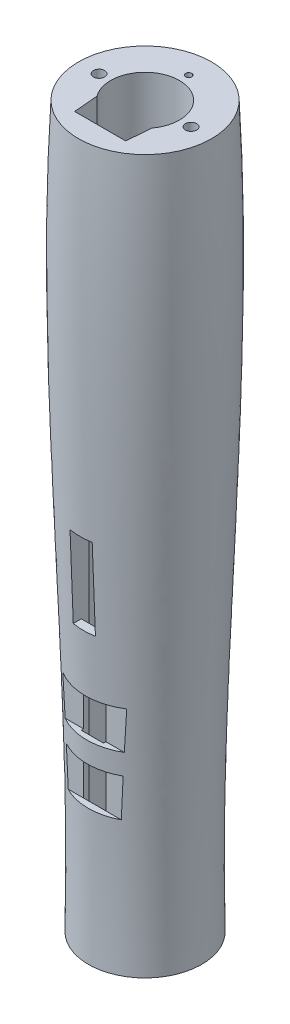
ISO-10303-21;
HEADER;
FILE_DESCRIPTION(('STEP AP214'),'2;1');
FILE_NAME('part.step','',(''),(''),'','','');
FILE_SCHEMA(('AUTOMOTIVE_DESIGN { 1 0 10303 214 1 1 1 1 }'));
ENDSEC;
DATA;
#1=APPLICATION_CONTEXT('core data for automotive mechanical design processes');
#2=APPLICATION_PROTOCOL_DEFINITION('international standard','automotive_design',2000,#1);
#3=PRODUCT_CONTEXT('',#1,'mechanical');
#4=PRODUCT('Part','Part','',(#3));
#5=PRODUCT_RELATED_PRODUCT_CATEGORY('part','',(#4));
#6=PRODUCT_DEFINITION_FORMATION('','',#4);
#7=PRODUCT_DEFINITION_CONTEXT('part definition',#1,'design');
#8=PRODUCT_DEFINITION('design','',#6,#7);
#9=PRODUCT_DEFINITION_SHAPE('','',#8);
#10=(LENGTH_UNIT() NAMED_UNIT(*) SI_UNIT(.MILLI.,.METRE.));
#11=(NAMED_UNIT(*) PLANE_ANGLE_UNIT() SI_UNIT($,.RADIAN.));
#12=(NAMED_UNIT(*) SI_UNIT($,.STERADIAN.) SOLID_ANGLE_UNIT());
#13=UNCERTAINTY_MEASURE_WITH_UNIT(LENGTH_MEASURE(1.E-05),#10,'distance_accuracy_value','');
#14=(GEOMETRIC_REPRESENTATION_CONTEXT(3) GLOBAL_UNCERTAINTY_ASSIGNED_CONTEXT((#13)) GLOBAL_UNIT_ASSIGNED_CONTEXT((#10,
#11,#12)) REPRESENTATION_CONTEXT('',''));
#15=CARTESIAN_POINT('',(0.,0.,0.));
#16=DIRECTION('',(0.,0.,1.));
#17=DIRECTION('',(1.,0.,0.));
#18=AXIS2_PLACEMENT_3D('',#15,#16,#17);
#19=CARTESIAN_POINT('',(-15.25,204.85,0.));
#20=CARTESIAN_POINT('',(-18.6607569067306,136.652495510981,0.));
#21=CARTESIAN_POINT('',(-8.44521283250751,68.0931069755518,0.));
#22=CARTESIAN_POINT('',(-15.25,0.,0.));
#23=B_SPLINE_CURVE_WITH_KNOTS('',3,(#19,#20,#21,#22),.UNSPECIFIED.,.F.,.F.,(4,4),(0.,1.),.UNSPECIFIED.);
#24=CARTESIAN_POINT('',(0.,0.,0.));
#25=DIRECTION('',(0.,-1.,0.));
#26=AXIS1_PLACEMENT('',#24,#25);
#27=SURFACE_OF_REVOLUTION('',#23,#26);
#28=CARTESIAN_POINT('',(0.,70.86,0.));
#29=DIRECTION('',(0.,-1.,0.));
#30=DIRECTION('',(0.,0.,-1.));
#31=AXIS2_PLACEMENT_3D('',#28,#29,#30);
#32=CIRCLE('',#31,13.0308951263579);
#33=CARTESIAN_POINT('',(6.08008908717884,70.86,11.5254823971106));
#34=VERTEX_POINT('',#33);
#35=CARTESIAN_POINT('',(-6.08008908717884,70.86,11.5254823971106));
#36=VERTEX_POINT('',#35);
#37=EDGE_CURVE('E295',#34,#36,#32,.T.);
#38=ORIENTED_EDGE('',*,*,#37,.T.);
#39=CARTESIAN_POINT('',(-6.50588851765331,79.76,11.5254823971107));
#40=CARTESIAN_POINT('',(-6.47930983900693,79.2656973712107,11.5254823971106));
#41=CARTESIAN_POINT('',(-6.45314593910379,78.771372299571,11.5254823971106));
#42=CARTESIAN_POINT('',(-6.40171921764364,77.7826795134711,11.5254823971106));
#43=CARTESIAN_POINT('',(-6.37645638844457,77.2883117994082,11.5254823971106));
#44=CARTESIAN_POINT('',(-6.32690299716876,76.299530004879,11.5254823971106));
#45=CARTESIAN_POINT('',(-6.30261243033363,75.8051159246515,11.5254823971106));
#46=CARTESIAN_POINT('',(-6.25507742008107,74.8162370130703,11.5254823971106));
#47=CARTESIAN_POINT('',(-6.2318329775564,74.3217721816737,11.5254823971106));
#48=CARTESIAN_POINT('',(-6.18646581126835,73.3327889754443,11.5254823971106));
#49=CARTESIAN_POINT('',(-6.16434309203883,72.8382706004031,11.5254823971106));
#50=CARTESIAN_POINT('',(-6.12129703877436,71.8491769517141,11.5254823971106));
#51=CARTESIAN_POINT('',(-6.10037371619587,71.3546016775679,11.5254823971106));
#52=CARTESIAN_POINT('',(-6.08008908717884,70.86,11.5254823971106));
#53=B_SPLINE_CURVE_WITH_KNOTS('',3,(#39,#40,#41,#42,#43,#44,#45,#46,#47,#48,#49,#50,#51,#52),
.UNSPECIFIED.,.F.,.F.,(4,2,2,2,2,2,4),(0.,1.48505007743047,2.97008755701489,4.45511776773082,
5.94014924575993,7.42518672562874,8.91023838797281),.UNSPECIFIED.);
#54=CARTESIAN_POINT('',(-6.50588851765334,79.76,11.5254823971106));
#55=VERTEX_POINT('',#54);
#56=EDGE_CURVE('E391',#55,#36,#53,.T.);
#57=ORIENTED_EDGE('',*,*,#56,.F.);
#58=CARTESIAN_POINT('',(0.,79.76,0.));
#59=DIRECTION('',(0.,-1.,0.));
#60=DIRECTION('',(0.,0.,-1.));
#61=AXIS2_PLACEMENT_3D('',#58,#59,#60);
#62=CIRCLE('',#61,13.23492840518);
#63=CARTESIAN_POINT('',(6.50588851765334,79.76,11.5254823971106));
#64=VERTEX_POINT('',#63);
#65=EDGE_CURVE('E292',#55,#64,#62,.F.);
#66=ORIENTED_EDGE('',*,*,#65,.T.);
#67=CARTESIAN_POINT('',(6.08008908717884,70.86,11.5254823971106));
#68=CARTESIAN_POINT('',(6.10037371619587,71.3546016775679,11.5254823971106));
#69=CARTESIAN_POINT('',(6.12129703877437,71.8491769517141,11.5254823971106));
#70=CARTESIAN_POINT('',(6.16434309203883,72.8382706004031,11.5254823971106));
#71=CARTESIAN_POINT('',(6.18646581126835,73.3327889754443,11.5254823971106));
#72=CARTESIAN_POINT('',(6.23183297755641,74.3217721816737,11.5254823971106));
#73=CARTESIAN_POINT('',(6.25507742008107,74.8162370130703,11.5254823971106));
#74=CARTESIAN_POINT('',(6.30261243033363,75.8051159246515,11.5254823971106));
#75=CARTESIAN_POINT('',(6.32690299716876,76.299530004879,11.5254823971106));
#76=CARTESIAN_POINT('',(6.37645638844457,77.2883117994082,11.5254823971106));
#77=CARTESIAN_POINT('',(6.40171921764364,77.7826795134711,11.5254823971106));
#78=CARTESIAN_POINT('',(6.45314593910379,78.771372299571,11.5254823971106));
#79=CARTESIAN_POINT('',(6.47930983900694,79.2656973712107,11.5254823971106));
#80=CARTESIAN_POINT('',(6.50588851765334,79.76,11.5254823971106));
#81=B_SPLINE_CURVE_WITH_KNOTS('',3,(#67,#68,#69,#70,#71,#72,#73,#74,#75,#76,#77,#78,#79,#80),
.UNSPECIFIED.,.F.,.F.,(4,2,2,2,2,2,4),(0.,1.48505166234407,2.97008914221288,4.45512062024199,
5.94015083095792,7.42518831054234,8.91023838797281),.UNSPECIFIED.);
#82=EDGE_CURVE('E397',#34,#64,#81,.T.);
#83=ORIENTED_EDGE('',*,*,#82,.F.);
#84=EDGE_LOOP('',(#38,#57,#66,#83));
#85=FACE_BOUND('',#84,.T.);
#86=CARTESIAN_POINT('',(0.,84.59,0.));
#87=DIRECTION('',(0.,-1.,0.));
#88=DIRECTION('',(0.,0.,-1.));
#89=AXIS2_PLACEMENT_3D('',#86,#87,#88);
#90=CIRCLE('',#89,13.3706468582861);
#91=CARTESIAN_POINT('',(6.7777173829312,84.59,11.5254823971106));
#92=VERTEX_POINT('',#91);
#93=CARTESIAN_POINT('',(-6.7777173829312,84.59,11.5254823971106));
#94=VERTEX_POINT('',#93);
#95=EDGE_CURVE('E294',#92,#94,#90,.T.);
#96=ORIENTED_EDGE('',*,*,#95,.T.);
#97=CARTESIAN_POINT('',(-7.32632067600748,93.49,11.5254823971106));
#98=CARTESIAN_POINT('',(-7.29464869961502,92.9956293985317,11.5254823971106));
#99=CARTESIAN_POINT('',(-7.26312403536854,92.5012493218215,11.5254823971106));
#100=CARTESIAN_POINT('',(-7.20041993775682,91.512468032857,11.5254823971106));
#101=CARTESIAN_POINT('',(-7.16924050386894,91.0180668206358,11.5254823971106));
#102=CARTESIAN_POINT('',(-7.10727740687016,90.0292400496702,11.5254823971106));
#103=CARTESIAN_POINT('',(-7.07649374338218,89.5348144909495,11.5254823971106));
#104=CARTESIAN_POINT('',(-7.01537536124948,88.5459354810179,11.5254823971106));
#105=CARTESIAN_POINT('',(-6.98504064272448,88.0514820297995,11.5254823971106));
#106=CARTESIAN_POINT('',(-6.92487520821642,87.0625440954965,11.5254823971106));
#107=CARTESIAN_POINT('',(-6.89504449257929,86.5680596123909,11.5254823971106));
#108=CARTESIAN_POINT('',(-6.83594498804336,85.5790561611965,11.5254823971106));
#109=CARTESIAN_POINT('',(-6.80667620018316,85.0845371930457,11.5254823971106));
#110=CARTESIAN_POINT('',(-6.77771738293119,84.59,11.5254823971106));
#111=B_SPLINE_CURVE_WITH_KNOTS('',3,(#97,#98,#99,#100,#101,#102,#103,#104,#105,#106,#107,#108,
#109,#110),.UNSPECIFIED.,.F.,.F.,(4,2,2,2,2,2,4),(0.,1.48615233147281,2.97230241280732,
4.45845107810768,5.94460013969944,7.43075022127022,8.91690304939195),.UNSPECIFIED.);
#112=CARTESIAN_POINT('',(-7.32632067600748,93.49,11.5254823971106));
#113=VERTEX_POINT('',#112);
#114=EDGE_CURVE('E355',#113,#94,#111,.T.);
#115=ORIENTED_EDGE('',*,*,#114,.F.);
#116=CARTESIAN_POINT('',(0.,93.49,0.));
#117=DIRECTION('',(0.,-1.,0.));
#118=DIRECTION('',(0.,0.,-1.));
#119=AXIS2_PLACEMENT_3D('',#116,#117,#118);
#120=CIRCLE('',#119,13.656929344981);
#121=CARTESIAN_POINT('',(7.32632067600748,93.49,11.5254823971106));
#122=VERTEX_POINT('',#121);
#123=EDGE_CURVE('E272',#113,#122,#120,.F.);
#124=ORIENTED_EDGE('',*,*,#123,.T.);
#125=CARTESIAN_POINT('',(6.77771738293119,84.59,11.5254823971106));
#126=CARTESIAN_POINT('',(6.80667620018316,85.0845371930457,11.5254823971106));
#127=CARTESIAN_POINT('',(6.83594498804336,85.5790561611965,11.5254823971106));
#128=CARTESIAN_POINT('',(6.89504449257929,86.5680596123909,11.5254823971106));
#129=CARTESIAN_POINT('',(6.92487520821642,87.0625440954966,11.5254823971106));
#130=CARTESIAN_POINT('',(6.98504064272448,88.0514820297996,11.5254823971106));
#131=CARTESIAN_POINT('',(7.01537536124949,88.5459354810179,11.5254823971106));
#132=CARTESIAN_POINT('',(7.07649374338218,89.5348144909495,11.5254823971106));
#133=CARTESIAN_POINT('',(7.10727740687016,90.0292400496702,11.5254823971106));
#134=CARTESIAN_POINT('',(7.16924050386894,91.0180668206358,11.5254823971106));
#135=CARTESIAN_POINT('',(7.20041993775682,91.512468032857,11.5254823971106));
#136=CARTESIAN_POINT('',(7.26312403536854,92.5012493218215,11.5254823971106));
#137=CARTESIAN_POINT('',(7.29464869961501,92.9956293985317,11.5254823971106));
#138=CARTESIAN_POINT('',(7.32632067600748,93.49,11.5254823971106));
#139=B_SPLINE_CURVE_WITH_KNOTS('',3,(#125,#126,#127,#128,#129,#130,#131,#132,#133,#134,#135,
#136,#137,#138),.UNSPECIFIED.,.F.,.F.,(4,2,2,2,2,2,4),(0.,1.48615282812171,2.97230290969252,
4.45845197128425,5.94460063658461,7.43075071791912,8.91690304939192),.UNSPECIFIED.);
#140=EDGE_CURVE('E358',#92,#122,#139,.T.);
#141=ORIENTED_EDGE('',*,*,#140,.F.);
#142=EDGE_LOOP('',(#96,#115,#124,#141));
#143=FACE_BOUND('',#142,.T.);
#144=CARTESIAN_POINT('',(0.,204.85,0.));
#145=DIRECTION('',(0.,-1.,0.));
#146=DIRECTION('',(0.,0.,-1.));
#147=AXIS2_PLACEMENT_3D('',#144,#145,#146);
#148=CIRCLE('',#147,15.25);
#149=CARTESIAN_POINT('',(0.,204.85,-15.25));
#150=VERTEX_POINT('',#149);
#151=EDGE_CURVE('E268',#150,#150,#148,.T.);
#152=ORIENTED_EDGE('',*,*,#151,.T.);
#153=EDGE_LOOP('',(#152));
#154=FACE_BOUND('',#153,.T.);
#155=CARTESIAN_POINT('',(0.,125.7,0.));
#156=DIRECTION('',(0.,-1.,0.));
#157=DIRECTION('',(0.,0.,-1.));
#158=AXIS2_PLACEMENT_3D('',#155,#156,#157);
#159=CIRCLE('',#158,14.8690766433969);
#160=CARTESIAN_POINT('',(-2.538,125.7,14.6508701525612));
#161=VERTEX_POINT('',#160);
#162=CARTESIAN_POINT('',(2.542,125.7,14.6501766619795));
#163=VERTEX_POINT('',#162);
#164=EDGE_CURVE('E271',#161,#163,#159,.F.);
#165=ORIENTED_EDGE('',*,*,#164,.T.);
#166=CARTESIAN_POINT('',(2.54200000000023,125.7,14.6501766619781));
#167=CARTESIAN_POINT('',(2.54200000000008,124.116594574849,14.5903733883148));
#168=CARTESIAN_POINT('',(2.54200000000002,122.533226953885,14.5295881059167));
#169=CARTESIAN_POINT('',(2.54199999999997,119.366538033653,14.4068231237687));
#170=CARTESIAN_POINT('',(2.54199999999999,117.783216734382,14.3448434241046));
#171=CARTESIAN_POINT('',(2.542,114.61659004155,14.2204591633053));
#172=CARTESIAN_POINT('',(2.542,113.033284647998,14.1580546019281));
#173=CARTESIAN_POINT('',(2.542,109.866660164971,14.0335917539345));
#174=CARTESIAN_POINT('',(2.54199999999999,108.283341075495,13.971533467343));
#175=CARTESIAN_POINT('',(2.542,106.7,13.9100338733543));
#176=B_SPLINE_CURVE_WITH_KNOTS('',3,(#166,#167,#168,#169,#170,#171,#172,#173,#174,#175),
.UNSPECIFIED.,.F.,.F.,(4,2,2,2,4),(0.,4.7536018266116,9.50720331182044,14.2608075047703,
19.0144120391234),.UNSPECIFIED.);
#177=CARTESIAN_POINT('',(2.542,106.7,13.9100338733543));
#178=VERTEX_POINT('',#177);
#179=EDGE_CURVE('E300',#163,#178,#176,.T.);
#180=ORIENTED_EDGE('',*,*,#179,.T.);
#181=CARTESIAN_POINT('',(0.,106.7,0.));
#182=DIRECTION('',(0.,-1.,0.));
#183=DIRECTION('',(0.,0.,-1.));
#184=AXIS2_PLACEMENT_3D('',#181,#182,#183);
#185=CIRCLE('',#184,14.14039625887);
#186=CARTESIAN_POINT('',(-2.538,106.7,13.9107642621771));
#187=VERTEX_POINT('',#186);
#188=EDGE_CURVE('E225',#178,#187,#185,.T.);
#189=ORIENTED_EDGE('',*,*,#188,.T.);
#190=CARTESIAN_POINT('',(-2.538,106.7,13.9107642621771));
#191=CARTESIAN_POINT('',(-2.538,108.283340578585,13.9722606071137));
#192=CARTESIAN_POINT('',(-2.538,109.866659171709,14.0343156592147));
#193=CARTESIAN_POINT('',(-2.538,113.033282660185,14.1587721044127));
#194=CARTESIAN_POINT('',(-2.538,114.616587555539,14.2211734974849));
#195=CARTESIAN_POINT('',(-2.538,117.783214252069,14.3455515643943));
#196=CARTESIAN_POINT('',(-2.538,119.366536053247,14.4075282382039));
#197=CARTESIAN_POINT('',(-2.538,122.533225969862,14.5302873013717));
#198=CARTESIAN_POINT('',(-2.538,124.116594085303,14.5910696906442));
#199=CARTESIAN_POINT('',(-2.538,125.7,14.6508701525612));
#200=B_SPLINE_CURVE_WITH_KNOTS('',3,(#190,#191,#192,#193,#194,#195,#196,#197,#198,#199),
.UNSPECIFIED.,.F.,.F.,(4,2,2,2,4),(0.,4.75360266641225,9.50720499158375,14.2608076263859,
19.0144106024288),.UNSPECIFIED.);
#201=EDGE_CURVE('E220',#187,#161,#200,.T.);
#202=ORIENTED_EDGE('',*,*,#201,.T.);
#203=EDGE_LOOP('',(#165,#180,#189,#202));
#204=FACE_BOUND('',#203,.T.);
#205=CARTESIAN_POINT('',(0.,39.85,0.));
#206=DIRECTION('',(0.,-1.,0.));
#207=DIRECTION('',(0.,0.,-1.));
#208=AXIS2_PLACEMENT_3D('',#205,#206,#207);
#209=CIRCLE('',#208,12.9841689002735);
#210=CARTESIAN_POINT('',(0.,39.85,-12.9841689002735));
#211=VERTEX_POINT('',#210);
#212=EDGE_CURVE('E11',#211,#211,#209,.T.);
#213=ORIENTED_EDGE('',*,*,#212,.F.);
#214=EDGE_LOOP('',(#213));
#215=FACE_BOUND('',#214,.T.);
#216=ADVANCED_FACE('F37',(#85,#143,#154,#204,#215),#27,.T.);
#217=CARTESIAN_POINT('',(0.,204.85,0.));
#218=DIRECTION('',(0.,-1.,0.));
#219=DIRECTION('',(0.,0.,-1.));
#220=AXIS2_PLACEMENT_3D('',#217,#218,#219);
#221=CYLINDRICAL_SURFACE('',#220,6.731);
#222=CARTESIAN_POINT('',(0.,39.85,0.));
#223=DIRECTION('',(0.,-1.,0.));
#224=DIRECTION('',(0.,0.,-1.));
#225=AXIS2_PLACEMENT_3D('',#222,#223,#224);
#226=CIRCLE('',#225,6.731);
#227=CARTESIAN_POINT('',(6.731,39.85,0.));
#228=VERTEX_POINT('',#227);
#229=CARTESIAN_POINT('',(-6.731,39.85,0.));
#230=VERTEX_POINT('',#229);
#231=EDGE_CURVE('E196',#228,#230,#226,.F.);
#232=ORIENTED_EDGE('',*,*,#231,.F.);
#233=DIRECTION('',(0.,-1.,0.));
#234=VECTOR('',#233,1.);
#235=CARTESIAN_POINT('',(6.731,204.85,0.));
#236=LINE('',#235,#234);
#237=CARTESIAN_POINT('',(6.731,150.75,0.));
#238=VERTEX_POINT('',#237);
#239=EDGE_CURVE('E264',#238,#228,#236,.T.);
#240=ORIENTED_EDGE('',*,*,#239,.F.);
#241=CARTESIAN_POINT('',(0.,150.75,0.));
#242=DIRECTION('',(0.,1.,0.));
#243=DIRECTION('',(0.,0.,1.));
#244=AXIS2_PLACEMENT_3D('',#241,#242,#243);
#245=CIRCLE('',#244,6.731);
#246=CARTESIAN_POINT('',(-6.731,150.75,0.));
#247=VERTEX_POINT('',#246);
#248=EDGE_CURVE('E218',#247,#238,#245,.F.);
#249=ORIENTED_EDGE('',*,*,#248,.F.);
#250=DIRECTION('',(0.,-1.,0.));
#251=VECTOR('',#250,1.);
#252=CARTESIAN_POINT('',(-6.731,204.85,0.));
#253=LINE('',#252,#251);
#254=EDGE_CURVE('E212',#247,#230,#253,.T.);
#255=ORIENTED_EDGE('',*,*,#254,.T.);
#256=EDGE_LOOP('',(#232,#240,#249,#255));
#257=FACE_BOUND('',#256,.T.);
#258=ADVANCED_FACE('F217',(#257),#221,.F.);
#259=CARTESIAN_POINT('',(-6.731,204.85,0.));
#260=DIRECTION('',(-0.996285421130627,0.,0.086112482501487));
#261=DIRECTION('',(0.0861124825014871,0.,0.996285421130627));
#262=AXIS2_PLACEMENT_3D('',#259,#260,#261);
#263=PLANE('',#262);
#264=DIRECTION('',(0.0861124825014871,0.,0.996285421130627));
#265=VECTOR('',#264,1.);
#266=CARTESIAN_POINT('',(-6.731,39.85,0.));
#267=LINE('',#266,#265);
#268=CARTESIAN_POINT('',(-5.842,39.85,10.2853583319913));
#269=VERTEX_POINT('',#268);
#270=EDGE_CURVE('E200',#230,#269,#267,.T.);
#271=ORIENTED_EDGE('',*,*,#270,.F.);
#272=ORIENTED_EDGE('',*,*,#254,.F.);
#273=DIRECTION('',(-0.0861124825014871,0.,-0.996285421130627));
#274=VECTOR('',#273,1.);
#275=CARTESIAN_POINT('',(-6.731,150.75,0.));
#276=LINE('',#275,#274);
#277=CARTESIAN_POINT('',(-6.32572865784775,150.75,4.68881999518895));
#278=VERTEX_POINT('',#277);
#279=EDGE_CURVE('E284',#278,#247,#276,.T.);
#280=ORIENTED_EDGE('',*,*,#279,.F.);
#281=DIRECTION('',(0.,1.,0.));
#282=VECTOR('',#281,1.);
#283=CARTESIAN_POINT('',(-6.32572865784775,150.75,4.68881999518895));
#284=LINE('',#283,#282);
#285=CARTESIAN_POINT('',(-6.32572865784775,204.85,4.68881999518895));
#286=VERTEX_POINT('',#285);
#287=EDGE_CURVE('E219',#278,#286,#284,.T.);
#288=ORIENTED_EDGE('',*,*,#287,.T.);
#289=DIRECTION('',(-0.0861124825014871,0.,-0.996285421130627));
#290=VECTOR('',#289,1.);
#291=CARTESIAN_POINT('',(-6.731,204.85,0.));
#292=LINE('',#291,#290);
#293=CARTESIAN_POINT('',(-5.842,204.85,10.2853583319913));
#294=VERTEX_POINT('',#293);
#295=EDGE_CURVE('E276',#294,#286,#292,.T.);
#296=ORIENTED_EDGE('',*,*,#295,.F.);
#297=DIRECTION('',(0.,-1.,0.));
#298=VECTOR('',#297,1.);
#299=CARTESIAN_POINT('',(-5.842,204.85,10.2853583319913));
#300=LINE('',#299,#298);
#301=EDGE_CURVE('E214',#294,#269,#300,.T.);
#302=ORIENTED_EDGE('',*,*,#301,.T.);
#303=EDGE_LOOP('',(#271,#272,#280,#288,#296,#302));
#304=FACE_BOUND('',#303,.T.);
#305=ADVANCED_FACE('F210',(#304),#263,.F.);
#306=CARTESIAN_POINT('',(-5.842,204.85,10.2853583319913));
#307=DIRECTION('',(0.,0.,1.));
#308=DIRECTION('',(1.,0.,0.));
#309=AXIS2_PLACEMENT_3D('',#306,#307,#308);
#310=PLANE('',#309);
#311=DIRECTION('',(0.,-1.,0.));
#312=VECTOR('',#311,1.);
#313=CARTESIAN_POINT('',(2.542,70.86,10.2853583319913));
#314=LINE('',#313,#312);
#315=CARTESIAN_POINT('',(2.542,135.8,10.2853583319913));
#316=VERTEX_POINT('',#315);
#317=CARTESIAN_POINT('',(2.542,60.7599999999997,10.2853583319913));
#318=VERTEX_POINT('',#317);
#319=EDGE_CURVE('E238',#316,#318,#314,.T.);
#320=ORIENTED_EDGE('',*,*,#319,.F.);
#321=DIRECTION('',(-1.,0.,0.));
#322=VECTOR('',#321,1.);
#323=CARTESIAN_POINT('',(-5.842,135.8,10.2853583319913));
#324=LINE('',#323,#322);
#325=CARTESIAN_POINT('',(-2.538,135.8,10.2853583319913));
#326=VERTEX_POINT('',#325);
#327=EDGE_CURVE('E255',#316,#326,#324,.T.);
#328=ORIENTED_EDGE('',*,*,#327,.T.);
#329=DIRECTION('',(0.,1.,0.));
#330=VECTOR('',#329,1.);
#331=CARTESIAN_POINT('',(-2.538,70.86,10.2853583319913));
#332=LINE('',#331,#330);
#333=CARTESIAN_POINT('',(-2.538,60.7599999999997,10.2853583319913));
#334=VERTEX_POINT('',#333);
#335=EDGE_CURVE('E234',#334,#326,#332,.T.);
#336=ORIENTED_EDGE('',*,*,#335,.F.);
#337=DIRECTION('',(1.,0.,0.));
#338=VECTOR('',#337,1.);
#339=CARTESIAN_POINT('',(-5.842,60.7599999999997,10.2853583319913));
#340=LINE('',#339,#338);
#341=EDGE_CURVE('E251',#334,#318,#340,.T.);
#342=ORIENTED_EDGE('',*,*,#341,.T.);
#343=EDGE_LOOP('',(#320,#328,#336,#342));
#344=FACE_BOUND('',#343,.T.);
#345=DIRECTION('',(1.,0.,0.));
#346=VECTOR('',#345,1.);
#347=CARTESIAN_POINT('',(-5.842,39.85,10.2853583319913));
#348=LINE('',#347,#346);
#349=CARTESIAN_POINT('',(5.842,39.8500000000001,10.2853583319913));
#350=VERTEX_POINT('',#349);
#351=EDGE_CURVE('E61',#269,#350,#348,.T.);
#352=ORIENTED_EDGE('',*,*,#351,.F.);
#353=ORIENTED_EDGE('',*,*,#301,.F.);
#354=DIRECTION('',(-1.,0.,0.));
#355=VECTOR('',#354,1.);
#356=CARTESIAN_POINT('',(-5.842,204.85,10.2853583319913));
#357=LINE('',#356,#355);
#358=CARTESIAN_POINT('',(5.842,204.85,10.2853583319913));
#359=VERTEX_POINT('',#358);
#360=EDGE_CURVE('E280',#359,#294,#357,.T.);
#361=ORIENTED_EDGE('',*,*,#360,.F.);
#362=DIRECTION('',(0.,-1.,0.));
#363=VECTOR('',#362,1.);
#364=CARTESIAN_POINT('',(5.842,204.85,10.2853583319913));
#365=LINE('',#364,#363);
#366=EDGE_CURVE('E254',#359,#350,#365,.T.);
#367=ORIENTED_EDGE('',*,*,#366,.T.);
#368=EDGE_LOOP('',(#352,#353,#361,#367));
#369=FACE_BOUND('',#368,.T.);
#370=ADVANCED_FACE('F483',(#344,#369),#310,.F.);
#371=CARTESIAN_POINT('',(5.842,204.85,10.2853583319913));
#372=DIRECTION('',(0.996285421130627,0.,0.0861124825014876));
#373=DIRECTION('',(0.0861124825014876,0.,-0.996285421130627));
#374=AXIS2_PLACEMENT_3D('',#371,#372,#373);
#375=PLANE('',#374);
#376=DIRECTION('',(0.0861124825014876,0.,-0.996285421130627));
#377=VECTOR('',#376,1.);
#378=CARTESIAN_POINT('',(5.842,39.85,10.2853583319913));
#379=LINE('',#378,#377);
#380=EDGE_CURVE('E48',#350,#228,#379,.T.);
#381=ORIENTED_EDGE('',*,*,#380,.F.);
#382=ORIENTED_EDGE('',*,*,#366,.F.);
#383=DIRECTION('',(-0.0861124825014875,0.,0.996285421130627));
#384=VECTOR('',#383,1.);
#385=CARTESIAN_POINT('',(5.842,204.85,10.2853583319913));
#386=LINE('',#385,#384);
#387=CARTESIAN_POINT('',(6.32572865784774,204.85,4.68881999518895));
#388=VERTEX_POINT('',#387);
#389=EDGE_CURVE('E279',#388,#359,#386,.T.);
#390=ORIENTED_EDGE('',*,*,#389,.F.);
#391=DIRECTION('',(0.,1.,0.));
#392=VECTOR('',#391,1.);
#393=CARTESIAN_POINT('',(6.32572865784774,150.75,4.68881999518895));
#394=LINE('',#393,#392);
#395=CARTESIAN_POINT('',(6.32572865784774,150.75,4.68881999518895));
#396=VERTEX_POINT('',#395);
#397=EDGE_CURVE('E261',#388,#396,#394,.F.);
#398=ORIENTED_EDGE('',*,*,#397,.T.);
#399=DIRECTION('',(-0.0861124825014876,0.,0.996285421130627));
#400=VECTOR('',#399,1.);
#401=CARTESIAN_POINT('',(5.842,150.75,10.2853583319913));
#402=LINE('',#401,#400);
#403=EDGE_CURVE('E265',#238,#396,#402,.T.);
#404=ORIENTED_EDGE('',*,*,#403,.F.);
#405=ORIENTED_EDGE('',*,*,#239,.T.);
#406=EDGE_LOOP('',(#381,#382,#390,#398,#404,#405));
#407=FACE_BOUND('',#406,.T.);
#408=ADVANCED_FACE('F470',(#407),#375,.F.);
#409=CARTESIAN_POINT('',(0.,204.85,0.));
#410=DIRECTION('',(0.,-1.,0.));
#411=DIRECTION('',(0.,0.,-1.));
#412=AXIS2_PLACEMENT_3D('',#409,#410,#411);
#413=PLANE('',#412);
#414=CARTESIAN_POINT('',(0.,204.85,-10.));
#415=DIRECTION('',(0.,1.,0.));
#416=DIRECTION('',(0.,0.,1.));
#417=AXIS2_PLACEMENT_3D('',#414,#415,#416);
#418=CIRCLE('',#417,0.7);
#419=CARTESIAN_POINT('',(0.,204.85,-9.3));
#420=VERTEX_POINT('',#419);
#421=EDGE_CURVE('E464',#420,#420,#418,.T.);
#422=ORIENTED_EDGE('',*,*,#421,.F.);
#423=EDGE_LOOP('',(#422));
#424=FACE_BOUND('',#423,.T.);
#425=CARTESIAN_POINT('',(-10.541,204.85,0.));
#426=DIRECTION('',(0.,1.,0.));
#427=DIRECTION('',(0.,0.,1.));
#428=AXIS2_PLACEMENT_3D('',#425,#426,#427);
#429=CIRCLE('',#428,1.28904999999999);
#430=CARTESIAN_POINT('',(-10.541,204.85,1.28904999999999));
#431=VERTEX_POINT('',#430);
#432=EDGE_CURVE('E455',#431,#431,#429,.T.);
#433=ORIENTED_EDGE('',*,*,#432,.F.);
#434=EDGE_LOOP('',(#433));
#435=FACE_BOUND('',#434,.T.);
#436=ORIENTED_EDGE('',*,*,#295,.T.);
#437=CARTESIAN_POINT('',(0.,204.85,0.));
#438=DIRECTION('',(0.,1.,0.));
#439=DIRECTION('',(0.,0.,1.));
#440=AXIS2_PLACEMENT_3D('',#437,#438,#439);
#441=CIRCLE('',#440,7.874);
#442=EDGE_CURVE('E286',#388,#286,#441,.T.);
#443=ORIENTED_EDGE('',*,*,#442,.F.);
#444=ORIENTED_EDGE('',*,*,#389,.T.);
#445=ORIENTED_EDGE('',*,*,#360,.T.);
#446=EDGE_LOOP('',(#436,#443,#444,#445));
#447=FACE_BOUND('',#446,.T.);
#448=ORIENTED_EDGE('',*,*,#151,.F.);
#449=EDGE_LOOP('',(#448));
#450=FACE_BOUND('',#449,.T.);
#451=CARTESIAN_POINT('',(10.541,204.85,0.));
#452=DIRECTION('',(0.,1.,0.));
#453=DIRECTION('',(0.,0.,1.));
#454=AXIS2_PLACEMENT_3D('',#451,#452,#453);
#455=CIRCLE('',#454,1.28904999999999);
#456=CARTESIAN_POINT('',(10.541,204.85,1.28904999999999));
#457=VERTEX_POINT('',#456);
#458=EDGE_CURVE('E205',#457,#457,#455,.T.);
#459=ORIENTED_EDGE('',*,*,#458,.F.);
#460=EDGE_LOOP('',(#459));
#461=FACE_BOUND('',#460,.T.);
#462=ADVANCED_FACE('F479',(#424,#435,#447,#450,#461),#413,.F.);
#463=CARTESIAN_POINT('',(2.542,70.86,20.2853583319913));
#464=DIRECTION('',(1.,0.,0.));
#465=DIRECTION('',(0.,0.,-1.));
#466=AXIS2_PLACEMENT_3D('',#463,#464,#465);
#467=PLANE('',#466);
#468=DIRECTION('',(0.,-1.,0.));
#469=VECTOR('',#468,1.);
#470=CARTESIAN_POINT('',(2.542,70.86,11.5254823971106));
#471=LINE('',#470,#469);
#472=CARTESIAN_POINT('',(2.542,79.76,11.5254823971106));
#473=VERTEX_POINT('',#472);
#474=CARTESIAN_POINT('',(2.542,70.86,11.5254823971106));
#475=VERTEX_POINT('',#474);
#476=EDGE_CURVE('E402',#473,#475,#471,.T.);
#477=ORIENTED_EDGE('',*,*,#476,.F.);
#478=DIRECTION('',(0.,0.,-1.));
#479=VECTOR('',#478,1.);
#480=CARTESIAN_POINT('',(2.542,79.76,20.2853583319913));
#481=LINE('',#480,#479);
#482=CARTESIAN_POINT('',(2.542,79.76,12.0653583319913));
#483=VERTEX_POINT('',#482);
#484=EDGE_CURVE('E435',#483,#473,#481,.T.);
#485=ORIENTED_EDGE('',*,*,#484,.F.);
#486=DIRECTION('',(0.,-1.,0.));
#487=VECTOR('',#486,1.);
#488=CARTESIAN_POINT('',(2.542,114.989568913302,12.0653583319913));
#489=LINE('',#488,#487);
#490=CARTESIAN_POINT('',(2.542,84.59,12.0653583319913));
#491=VERTEX_POINT('',#490);
#492=EDGE_CURVE('E350',#491,#483,#489,.T.);
#493=ORIENTED_EDGE('',*,*,#492,.F.);
#494=DIRECTION('',(0.,0.,1.));
#495=VECTOR('',#494,1.);
#496=CARTESIAN_POINT('',(2.542,84.59,20.2853583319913));
#497=LINE('',#496,#495);
#498=CARTESIAN_POINT('',(2.542,84.59,11.5254823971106));
#499=VERTEX_POINT('',#498);
#500=EDGE_CURVE('E432',#499,#491,#497,.T.);
#501=ORIENTED_EDGE('',*,*,#500,.F.);
#502=DIRECTION('',(0.,-1.,0.));
#503=VECTOR('',#502,1.);
#504=CARTESIAN_POINT('',(2.542,70.86,11.5254823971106));
#505=LINE('',#504,#503);
#506=CARTESIAN_POINT('',(2.542,93.49,11.5254823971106));
#507=VERTEX_POINT('',#506);
#508=EDGE_CURVE('E365',#507,#499,#505,.T.);
#509=ORIENTED_EDGE('',*,*,#508,.F.);
#510=DIRECTION('',(0.,0.,-1.));
#511=VECTOR('',#510,1.);
#512=CARTESIAN_POINT('',(2.542,93.49,20.2853583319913));
#513=LINE('',#512,#511);
#514=CARTESIAN_POINT('',(2.542,93.49,12.0653583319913));
#515=VERTEX_POINT('',#514);
#516=EDGE_CURVE('E331',#515,#507,#513,.T.);
#517=ORIENTED_EDGE('',*,*,#516,.F.);
#518=CARTESIAN_POINT('',(2.542,106.7,12.0653583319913));
#519=VERTEX_POINT('',#518);
#520=EDGE_CURVE('E342',#519,#515,#489,.T.);
#521=ORIENTED_EDGE('',*,*,#520,.F.);
#522=DIRECTION('',(0.,0.,-1.));
#523=VECTOR('',#522,1.);
#524=CARTESIAN_POINT('',(2.542,106.7,20.2853583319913));
#525=LINE('',#524,#523);
#526=EDGE_CURVE('E328',#178,#519,#525,.T.);
#527=ORIENTED_EDGE('',*,*,#526,.F.);
#528=ORIENTED_EDGE('',*,*,#179,.F.);
#529=DIRECTION('',(0.,0.,-1.));
#530=VECTOR('',#529,1.);
#531=CARTESIAN_POINT('',(2.542,125.7,20.2853583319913));
#532=LINE('',#531,#530);
#533=CARTESIAN_POINT('',(2.542,125.7,11.5254823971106));
#534=VERTEX_POINT('',#533);
#535=EDGE_CURVE('E239',#163,#534,#532,.T.);
#536=ORIENTED_EDGE('',*,*,#535,.T.);
#537=DIRECTION('',(0.,-0.992546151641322,0.121869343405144));
#538=VECTOR('',#537,1.);
#539=CARTESIAN_POINT('',(2.542,105.922587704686,13.9538432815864));
#540=LINE('',#539,#538);
#541=EDGE_CURVE('E235',#534,#316,#540,.F.);
#542=ORIENTED_EDGE('',*,*,#541,.T.);
#543=ORIENTED_EDGE('',*,*,#319,.T.);
#544=DIRECTION('',(0.,-0.992546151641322,-0.121869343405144));
#545=VECTOR('',#544,1.);
#546=CARTESIAN_POINT('',(2.542,71.9196028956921,11.6555852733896));
#547=LINE('',#546,#545);
#548=EDGE_CURVE('E240',#318,#475,#547,.F.);
#549=ORIENTED_EDGE('',*,*,#548,.T.);
#550=EDGE_LOOP('',(#477,#485,#493,#501,#509,#517,#521,#527,#528,#536,#542,#543,#549));
#551=FACE_BOUND('',#550,.T.);
#552=ADVANCED_FACE('F538',(#551),#467,.F.);
#553=CARTESIAN_POINT('',(-2.538,70.86,20.2853583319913));
#554=DIRECTION('',(-1.,0.,0.));
#555=DIRECTION('',(0.,0.,1.));
#556=AXIS2_PLACEMENT_3D('',#553,#554,#555);
#557=PLANE('',#556);
#558=DIRECTION('',(0.,1.,0.));
#559=VECTOR('',#558,1.);
#560=CARTESIAN_POINT('',(-2.538,70.86,11.5254823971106));
#561=LINE('',#560,#559);
#562=CARTESIAN_POINT('',(-2.538,70.86,11.5254823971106));
#563=VERTEX_POINT('',#562);
#564=CARTESIAN_POINT('',(-2.538,79.76,11.5254823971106));
#565=VERTEX_POINT('',#564);
#566=EDGE_CURVE('E366',#563,#565,#561,.T.);
#567=ORIENTED_EDGE('',*,*,#566,.F.);
#568=DIRECTION('',(0.,0.992546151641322,0.121869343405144));
#569=VECTOR('',#568,1.);
#570=CARTESIAN_POINT('',(-2.538,71.9196028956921,11.6555852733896));
#571=LINE('',#570,#569);
#572=EDGE_CURVE('E243',#563,#334,#571,.F.);
#573=ORIENTED_EDGE('',*,*,#572,.T.);
#574=ORIENTED_EDGE('',*,*,#335,.T.);
#575=DIRECTION('',(0.,0.992546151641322,-0.121869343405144));
#576=VECTOR('',#575,1.);
#577=CARTESIAN_POINT('',(-2.538,105.922587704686,13.9538432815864));
#578=LINE('',#577,#576);
#579=CARTESIAN_POINT('',(-2.538,125.7,11.5254823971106));
#580=VERTEX_POINT('',#579);
#581=EDGE_CURVE('E231',#326,#580,#578,.F.);
#582=ORIENTED_EDGE('',*,*,#581,.T.);
#583=DIRECTION('',(0.,0.,-1.));
#584=VECTOR('',#583,1.);
#585=CARTESIAN_POINT('',(-2.538,125.7,20.2853583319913));
#586=LINE('',#585,#584);
#587=EDGE_CURVE('E250',#161,#580,#586,.T.);
#588=ORIENTED_EDGE('',*,*,#587,.F.);
#589=ORIENTED_EDGE('',*,*,#201,.F.);
#590=DIRECTION('',(0.,0.,-1.));
#591=VECTOR('',#590,1.);
#592=CARTESIAN_POINT('',(-2.538,106.7,20.2853583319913));
#593=LINE('',#592,#591);
#594=CARTESIAN_POINT('',(-2.538,106.7,12.0653583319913));
#595=VERTEX_POINT('',#594);
#596=EDGE_CURVE('E233',#187,#595,#593,.T.);
#597=ORIENTED_EDGE('',*,*,#596,.T.);
#598=DIRECTION('',(0.,1.,0.));
#599=VECTOR('',#598,1.);
#600=CARTESIAN_POINT('',(-2.538,114.989568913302,12.0653583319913));
#601=LINE('',#600,#599);
#602=CARTESIAN_POINT('',(-2.538,93.49,12.0653583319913));
#603=VERTEX_POINT('',#602);
#604=EDGE_CURVE('E347',#603,#595,#601,.T.);
#605=ORIENTED_EDGE('',*,*,#604,.F.);
#606=DIRECTION('',(0.,0.,1.));
#607=VECTOR('',#606,1.);
#608=CARTESIAN_POINT('',(-2.538,93.49,20.2853583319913));
#609=LINE('',#608,#607);
#610=CARTESIAN_POINT('',(-2.538,93.49,11.5254823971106));
#611=VERTEX_POINT('',#610);
#612=EDGE_CURVE('E433',#611,#603,#609,.T.);
#613=ORIENTED_EDGE('',*,*,#612,.F.);
#614=DIRECTION('',(0.,1.,0.));
#615=VECTOR('',#614,1.);
#616=CARTESIAN_POINT('',(-2.538,70.86,11.5254823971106));
#617=LINE('',#616,#615);
#618=CARTESIAN_POINT('',(-2.538,84.59,11.5254823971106));
#619=VERTEX_POINT('',#618);
#620=EDGE_CURVE('E414',#619,#611,#617,.T.);
#621=ORIENTED_EDGE('',*,*,#620,.F.);
#622=DIRECTION('',(0.,0.,-1.));
#623=VECTOR('',#622,1.);
#624=CARTESIAN_POINT('',(-2.538,84.59,20.2853583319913));
#625=LINE('',#624,#623);
#626=CARTESIAN_POINT('',(-2.538,84.59,12.0653583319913));
#627=VERTEX_POINT('',#626);
#628=EDGE_CURVE('E428',#627,#619,#625,.T.);
#629=ORIENTED_EDGE('',*,*,#628,.F.);
#630=CARTESIAN_POINT('',(-2.538,79.76,12.0653583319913));
#631=VERTEX_POINT('',#630);
#632=EDGE_CURVE('E343',#631,#627,#601,.T.);
#633=ORIENTED_EDGE('',*,*,#632,.F.);
#634=DIRECTION('',(0.,0.,1.));
#635=VECTOR('',#634,1.);
#636=CARTESIAN_POINT('',(-2.538,79.76,20.2853583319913));
#637=LINE('',#636,#635);
#638=EDGE_CURVE('E289',#565,#631,#637,.T.);
#639=ORIENTED_EDGE('',*,*,#638,.F.);
#640=EDGE_LOOP('',(#567,#573,#574,#582,#588,#589,#597,#605,#613,#621,#629,#633,#639));
#641=FACE_BOUND('',#640,.T.);
#642=ADVANCED_FACE('F316',(#641),#557,.F.);
#643=CARTESIAN_POINT('',(2.542,106.7,20.2853583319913));
#644=DIRECTION('',(0.,-1.,0.));
#645=DIRECTION('',(0.,0.,-1.));
#646=AXIS2_PLACEMENT_3D('',#643,#644,#645);
#647=PLANE('',#646);
#648=DIRECTION('',(1.,0.,0.));
#649=VECTOR('',#648,1.);
#650=CARTESIAN_POINT('',(2.542,106.7,12.0653583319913));
#651=LINE('',#650,#649);
#652=EDGE_CURVE('E340',#595,#519,#651,.T.);
#653=ORIENTED_EDGE('',*,*,#652,.F.);
#654=ORIENTED_EDGE('',*,*,#596,.F.);
#655=ORIENTED_EDGE('',*,*,#188,.F.);
#656=ORIENTED_EDGE('',*,*,#526,.T.);
#657=EDGE_LOOP('',(#653,#654,#655,#656));
#658=FACE_BOUND('',#657,.T.);
#659=ADVANCED_FACE('F312',(#658),#647,.F.);
#660=CARTESIAN_POINT('',(2.542,93.49,20.2853583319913));
#661=DIRECTION('',(0.,1.,0.));
#662=DIRECTION('',(0.,0.,1.));
#663=AXIS2_PLACEMENT_3D('',#660,#661,#662);
#664=PLANE('',#663);
#665=DIRECTION('',(-1.,0.,0.));
#666=VECTOR('',#665,1.);
#667=CARTESIAN_POINT('',(2.542,93.49,12.0653583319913));
#668=LINE('',#667,#666);
#669=EDGE_CURVE('E344',#515,#603,#668,.T.);
#670=ORIENTED_EDGE('',*,*,#669,.F.);
#671=ORIENTED_EDGE('',*,*,#516,.T.);
#672=DIRECTION('',(1.,0.,0.));
#673=VECTOR('',#672,1.);
#674=CARTESIAN_POINT('',(-17.458,93.49,11.5254823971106));
#675=LINE('',#674,#673);
#676=EDGE_CURVE('E439',#507,#122,#675,.T.);
#677=ORIENTED_EDGE('',*,*,#676,.T.);
#678=ORIENTED_EDGE('',*,*,#123,.F.);
#679=EDGE_CURVE('E423',#113,#611,#675,.T.);
#680=ORIENTED_EDGE('',*,*,#679,.T.);
#681=ORIENTED_EDGE('',*,*,#612,.T.);
#682=EDGE_LOOP('',(#670,#671,#677,#678,#680,#681));
#683=FACE_BOUND('',#682,.T.);
#684=ADVANCED_FACE('F315',(#683),#664,.F.);
#685=CARTESIAN_POINT('',(2.542,84.59,20.2853583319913));
#686=DIRECTION('',(0.,-1.,0.));
#687=DIRECTION('',(0.,0.,-1.));
#688=AXIS2_PLACEMENT_3D('',#685,#686,#687);
#689=PLANE('',#688);
#690=DIRECTION('',(1.,0.,0.));
#691=VECTOR('',#690,1.);
#692=CARTESIAN_POINT('',(2.542,84.59,12.0653583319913));
#693=LINE('',#692,#691);
#694=EDGE_CURVE('E260',#627,#491,#693,.T.);
#695=ORIENTED_EDGE('',*,*,#694,.F.);
#696=ORIENTED_EDGE('',*,*,#628,.T.);
#697=DIRECTION('',(1.,0.,0.));
#698=VECTOR('',#697,1.);
#699=CARTESIAN_POINT('',(-17.458,84.59,11.5254823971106));
#700=LINE('',#699,#698);
#701=EDGE_CURVE('E409',#94,#619,#700,.T.);
#702=ORIENTED_EDGE('',*,*,#701,.F.);
#703=ORIENTED_EDGE('',*,*,#95,.F.);
#704=EDGE_CURVE('E403',#499,#92,#700,.T.);
#705=ORIENTED_EDGE('',*,*,#704,.F.);
#706=ORIENTED_EDGE('',*,*,#500,.T.);
#707=EDGE_LOOP('',(#695,#696,#702,#703,#705,#706));
#708=FACE_BOUND('',#707,.T.);
#709=ADVANCED_FACE('F427',(#708),#689,.F.);
#710=CARTESIAN_POINT('',(2.542,79.76,20.2853583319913));
#711=DIRECTION('',(0.,1.,0.));
#712=DIRECTION('',(0.,0.,1.));
#713=AXIS2_PLACEMENT_3D('',#710,#711,#712);
#714=PLANE('',#713);
#715=DIRECTION('',(-1.,0.,0.));
#716=VECTOR('',#715,1.);
#717=CARTESIAN_POINT('',(2.542,79.76,12.0653583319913));
#718=LINE('',#717,#716);
#719=EDGE_CURVE('E351',#483,#631,#718,.T.);
#720=ORIENTED_EDGE('',*,*,#719,.F.);
#721=ORIENTED_EDGE('',*,*,#484,.T.);
#722=DIRECTION('',(1.,0.,0.));
#723=VECTOR('',#722,1.);
#724=CARTESIAN_POINT('',(-17.458,79.76,11.5254823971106));
#725=LINE('',#724,#723);
#726=EDGE_CURVE('E449',#473,#64,#725,.T.);
#727=ORIENTED_EDGE('',*,*,#726,.T.);
#728=ORIENTED_EDGE('',*,*,#65,.F.);
#729=EDGE_CURVE('E452',#55,#565,#725,.T.);
#730=ORIENTED_EDGE('',*,*,#729,.T.);
#731=ORIENTED_EDGE('',*,*,#638,.T.);
#732=EDGE_LOOP('',(#720,#721,#727,#728,#730,#731));
#733=FACE_BOUND('',#732,.T.);
#734=ADVANCED_FACE('F596',(#733),#714,.F.);
#735=CARTESIAN_POINT('',(0.,150.75,0.));
#736=DIRECTION('',(0.,1.,0.));
#737=DIRECTION('',(0.,0.,1.));
#738=AXIS2_PLACEMENT_3D('',#735,#736,#737);
#739=CYLINDRICAL_SURFACE('',#738,7.874);
#740=CARTESIAN_POINT('',(0.,150.75,0.));
#741=DIRECTION('',(0.,1.,0.));
#742=DIRECTION('',(0.,0.,1.));
#743=AXIS2_PLACEMENT_3D('',#740,#741,#742);
#744=CIRCLE('',#743,7.874);
#745=EDGE_CURVE('E267',#396,#278,#744,.T.);
#746=ORIENTED_EDGE('',*,*,#745,.F.);
#747=ORIENTED_EDGE('',*,*,#397,.F.);
#748=ORIENTED_EDGE('',*,*,#442,.T.);
#749=ORIENTED_EDGE('',*,*,#287,.F.);
#750=EDGE_LOOP('',(#746,#747,#748,#749));
#751=FACE_BOUND('',#750,.T.);
#752=ADVANCED_FACE('F476',(#751),#739,.F.);
#753=CARTESIAN_POINT('',(0.,150.75,0.));
#754=DIRECTION('',(0.,1.,0.));
#755=DIRECTION('',(0.,0.,1.));
#756=AXIS2_PLACEMENT_3D('',#753,#754,#755);
#757=PLANE('',#756);
#758=ORIENTED_EDGE('',*,*,#279,.T.);
#759=ORIENTED_EDGE('',*,*,#248,.T.);
#760=ORIENTED_EDGE('',*,*,#403,.T.);
#761=ORIENTED_EDGE('',*,*,#745,.T.);
#762=EDGE_LOOP('',(#758,#759,#760,#761));
#763=FACE_BOUND('',#762,.T.);
#764=ADVANCED_FACE('F310',(#763),#757,.T.);
#765=CARTESIAN_POINT('',(2.542,125.7,20.2853583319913));
#766=DIRECTION('',(0.,1.,0.));
#767=DIRECTION('',(0.,0.,1.));
#768=AXIS2_PLACEMENT_3D('',#765,#766,#767);
#769=PLANE('',#768);
#770=ORIENTED_EDGE('',*,*,#587,.T.);
#771=DIRECTION('',(1.,0.,0.));
#772=VECTOR('',#771,1.);
#773=CARTESIAN_POINT('',(2.542,125.7,11.5254823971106));
#774=LINE('',#773,#772);
#775=EDGE_CURVE('E246',#580,#534,#774,.T.);
#776=ORIENTED_EDGE('',*,*,#775,.T.);
#777=ORIENTED_EDGE('',*,*,#535,.F.);
#778=ORIENTED_EDGE('',*,*,#164,.F.);
#779=EDGE_LOOP('',(#770,#776,#777,#778));
#780=FACE_BOUND('',#779,.T.);
#781=ADVANCED_FACE('F320',(#780),#769,.F.);
#782=CARTESIAN_POINT('',(2.542,70.86,20.2853583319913));
#783=DIRECTION('',(0.,-1.,0.));
#784=DIRECTION('',(0.,0.,-1.));
#785=AXIS2_PLACEMENT_3D('',#782,#783,#784);
#786=PLANE('',#785);
#787=ORIENTED_EDGE('',*,*,#37,.F.);
#788=DIRECTION('',(1.,0.,0.));
#789=VECTOR('',#788,1.);
#790=CARTESIAN_POINT('',(-17.458,70.86,11.5254823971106));
#791=LINE('',#790,#789);
#792=EDGE_CURVE('E444',#475,#34,#791,.T.);
#793=ORIENTED_EDGE('',*,*,#792,.F.);
#794=DIRECTION('',(-1.,0.,0.));
#795=VECTOR('',#794,1.);
#796=CARTESIAN_POINT('',(2.542,70.86,11.5254823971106));
#797=LINE('',#796,#795);
#798=EDGE_CURVE('E249',#475,#563,#797,.T.);
#799=ORIENTED_EDGE('',*,*,#798,.T.);
#800=EDGE_CURVE('E448',#36,#563,#791,.T.);
#801=ORIENTED_EDGE('',*,*,#800,.F.);
#802=EDGE_LOOP('',(#787,#793,#799,#801));
#803=FACE_BOUND('',#802,.T.);
#804=ADVANCED_FACE('F553',(#803),#786,.F.);
#805=CARTESIAN_POINT('',(2.542,70.86,11.5254823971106));
#806=DIRECTION('',(0.,-0.121869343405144,0.992546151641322));
#807=DIRECTION('',(-1.,0.,0.));
#808=AXIS2_PLACEMENT_3D('',#805,#806,#807);
#809=PLANE('',#808);
#810=ORIENTED_EDGE('',*,*,#548,.F.);
#811=ORIENTED_EDGE('',*,*,#341,.F.);
#812=ORIENTED_EDGE('',*,*,#572,.F.);
#813=ORIENTED_EDGE('',*,*,#798,.F.);
#814=EDGE_LOOP('',(#810,#811,#812,#813));
#815=FACE_BOUND('',#814,.T.);
#816=ADVANCED_FACE('F549',(#815),#809,.F.);
#817=CARTESIAN_POINT('',(2.542,125.7,11.5254823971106));
#818=DIRECTION('',(0.,0.121869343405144,0.992546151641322));
#819=DIRECTION('',(1.,0.,0.));
#820=AXIS2_PLACEMENT_3D('',#817,#818,#819);
#821=PLANE('',#820);
#822=ORIENTED_EDGE('',*,*,#581,.F.);
#823=ORIENTED_EDGE('',*,*,#327,.F.);
#824=ORIENTED_EDGE('',*,*,#541,.F.);
#825=ORIENTED_EDGE('',*,*,#775,.F.);
#826=EDGE_LOOP('',(#822,#823,#824,#825));
#827=FACE_BOUND('',#826,.T.);
#828=ADVANCED_FACE('F552',(#827),#821,.F.);
#829=CARTESIAN_POINT('',(0.,0.,12.0653583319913));
#830=DIRECTION('',(0.,0.,-1.));
#831=DIRECTION('',(-1.,0.,0.));
#832=AXIS2_PLACEMENT_3D('',#829,#830,#831);
#833=PLANE('',#832);
#834=ORIENTED_EDGE('',*,*,#694,.T.);
#835=ORIENTED_EDGE('',*,*,#492,.T.);
#836=ORIENTED_EDGE('',*,*,#719,.T.);
#837=ORIENTED_EDGE('',*,*,#632,.T.);
#838=EDGE_LOOP('',(#834,#835,#836,#837));
#839=FACE_BOUND('',#838,.T.);
#840=ADVANCED_FACE('F556',(#839),#833,.T.);
#841=ORIENTED_EDGE('',*,*,#652,.T.);
#842=ORIENTED_EDGE('',*,*,#520,.T.);
#843=ORIENTED_EDGE('',*,*,#669,.T.);
#844=ORIENTED_EDGE('',*,*,#604,.T.);
#845=EDGE_LOOP('',(#841,#842,#843,#844));
#846=FACE_BOUND('',#845,.T.);
#847=ADVANCED_FACE('F380',(#846),#833,.T.);
#848=CARTESIAN_POINT('',(-17.458,84.59,11.5254823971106));
#849=DIRECTION('',(0.,0.,1.));
#850=DIRECTION('',(1.,0.,0.));
#851=AXIS2_PLACEMENT_3D('',#848,#849,#850);
#852=PLANE('',#851);
#853=ORIENTED_EDGE('',*,*,#114,.T.);
#854=ORIENTED_EDGE('',*,*,#701,.T.);
#855=ORIENTED_EDGE('',*,*,#620,.T.);
#856=ORIENTED_EDGE('',*,*,#679,.F.);
#857=EDGE_LOOP('',(#853,#854,#855,#856));
#858=FACE_BOUND('',#857,.T.);
#859=ADVANCED_FACE('F379',(#858),#852,.T.);
#860=CARTESIAN_POINT('',(-17.458,70.86,11.5254823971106));
#861=DIRECTION('',(0.,0.,1.));
#862=DIRECTION('',(1.,0.,0.));
#863=AXIS2_PLACEMENT_3D('',#860,#861,#862);
#864=PLANE('',#863);
#865=ORIENTED_EDGE('',*,*,#56,.T.);
#866=ORIENTED_EDGE('',*,*,#800,.T.);
#867=ORIENTED_EDGE('',*,*,#566,.T.);
#868=ORIENTED_EDGE('',*,*,#729,.F.);
#869=EDGE_LOOP('',(#865,#866,#867,#868));
#870=FACE_BOUND('',#869,.T.);
#871=ADVANCED_FACE('F377',(#870),#864,.T.);
#872=ORIENTED_EDGE('',*,*,#140,.T.);
#873=ORIENTED_EDGE('',*,*,#676,.F.);
#874=ORIENTED_EDGE('',*,*,#508,.T.);
#875=ORIENTED_EDGE('',*,*,#704,.T.);
#876=EDGE_LOOP('',(#872,#873,#874,#875));
#877=FACE_BOUND('',#876,.T.);
#878=ADVANCED_FACE('F371',(#877),#852,.T.);
#879=ORIENTED_EDGE('',*,*,#82,.T.);
#880=ORIENTED_EDGE('',*,*,#726,.F.);
#881=ORIENTED_EDGE('',*,*,#476,.T.);
#882=ORIENTED_EDGE('',*,*,#792,.T.);
#883=EDGE_LOOP('',(#879,#880,#881,#882));
#884=FACE_BOUND('',#883,.T.);
#885=ADVANCED_FACE('F376',(#884),#864,.T.);
#886=CARTESIAN_POINT('',(-10.541,179.35,0.));
#887=DIRECTION('',(0.,1.,0.));
#888=DIRECTION('',(0.,0.,1.));
#889=AXIS2_PLACEMENT_3D('',#886,#887,#888);
#890=CONICAL_SURFACE('',#889,1.28904999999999,1.02974425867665);
#891=CARTESIAN_POINT('',(-10.541,178.575460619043,0.));
#892=VERTEX_POINT('',#891);
#893=VERTEX_LOOP('',#892);
#894=FACE_BOUND('',#893,.T.);
#895=CARTESIAN_POINT('',(-10.541,179.35,0.));
#896=DIRECTION('',(0.,1.,0.));
#897=DIRECTION('',(0.,0.,1.));
#898=AXIS2_PLACEMENT_3D('',#895,#896,#897);
#899=CIRCLE('',#898,1.28904999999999);
#900=CARTESIAN_POINT('',(-10.541,179.35,1.28904999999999));
#901=VERTEX_POINT('',#900);
#902=EDGE_CURVE('E447',#901,#901,#899,.T.);
#903=ORIENTED_EDGE('',*,*,#902,.T.);
#904=EDGE_LOOP('',(#903));
#905=FACE_BOUND('',#904,.T.);
#906=ADVANCED_FACE('F386',(#894,#905),#890,.F.);
#907=CARTESIAN_POINT('',(-10.541,204.85,0.));
#908=DIRECTION('',(0.,1.,0.));
#909=DIRECTION('',(0.,0.,1.));
#910=AXIS2_PLACEMENT_3D('',#907,#908,#909);
#911=CYLINDRICAL_SURFACE('',#910,1.28904999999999);
#912=ORIENTED_EDGE('',*,*,#902,.F.);
#913=EDGE_LOOP('',(#912));
#914=FACE_BOUND('',#913,.T.);
#915=ORIENTED_EDGE('',*,*,#432,.T.);
#916=EDGE_LOOP('',(#915));
#917=FACE_BOUND('',#916,.T.);
#918=ADVANCED_FACE('F526',(#914,#917),#911,.F.);
#919=CARTESIAN_POINT('',(10.541,179.35,0.));
#920=DIRECTION('',(0.,1.,0.));
#921=DIRECTION('',(0.,0.,1.));
#922=AXIS2_PLACEMENT_3D('',#919,#920,#921);
#923=CONICAL_SURFACE('',#922,1.28904999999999,1.02974425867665);
#924=CARTESIAN_POINT('',(10.541,178.575460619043,0.));
#925=VERTEX_POINT('',#924);
#926=VERTEX_LOOP('',#925);
#927=FACE_BOUND('',#926,.T.);
#928=CARTESIAN_POINT('',(10.541,179.35,0.));
#929=DIRECTION('',(0.,1.,0.));
#930=DIRECTION('',(0.,0.,1.));
#931=AXIS2_PLACEMENT_3D('',#928,#929,#930);
#932=CIRCLE('',#931,1.28904999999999);
#933=CARTESIAN_POINT('',(10.541,179.35,1.28904999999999));
#934=VERTEX_POINT('',#933);
#935=EDGE_CURVE('E458',#934,#934,#932,.T.);
#936=ORIENTED_EDGE('',*,*,#935,.T.);
#937=EDGE_LOOP('',(#936));
#938=FACE_BOUND('',#937,.T.);
#939=ADVANCED_FACE('F520',(#927,#938),#923,.F.);
#940=CARTESIAN_POINT('',(10.541,204.85,0.));
#941=DIRECTION('',(0.,1.,0.));
#942=DIRECTION('',(0.,0.,1.));
#943=AXIS2_PLACEMENT_3D('',#940,#941,#942);
#944=CYLINDRICAL_SURFACE('',#943,1.28904999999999);
#945=ORIENTED_EDGE('',*,*,#935,.F.);
#946=EDGE_LOOP('',(#945));
#947=FACE_BOUND('',#946,.T.);
#948=ORIENTED_EDGE('',*,*,#458,.T.);
#949=EDGE_LOOP('',(#948));
#950=FACE_BOUND('',#949,.T.);
#951=ADVANCED_FACE('F510',(#947,#950),#944,.F.);
#952=CARTESIAN_POINT('',(0.,39.85,0.));
#953=DIRECTION('',(0.,-1.,0.));
#954=DIRECTION('',(0.,0.,-1.));
#955=AXIS2_PLACEMENT_3D('',#952,#953,#954);
#956=PLANE('',#955);
#957=CARTESIAN_POINT('',(0.,39.85,-10.));
#958=DIRECTION('',(0.,1.,0.));
#959=DIRECTION('',(0.,0.,1.));
#960=AXIS2_PLACEMENT_3D('',#957,#958,#959);
#961=CIRCLE('',#960,0.7);
#962=CARTESIAN_POINT('',(0.,39.85,-9.3));
#963=VERTEX_POINT('',#962);
#964=EDGE_CURVE('E297',#963,#963,#961,.T.);
#965=ORIENTED_EDGE('',*,*,#964,.T.);
#966=EDGE_LOOP('',(#965));
#967=FACE_BOUND('',#966,.T.);
#968=ORIENTED_EDGE('',*,*,#231,.T.);
#969=ORIENTED_EDGE('',*,*,#270,.T.);
#970=ORIENTED_EDGE('',*,*,#351,.T.);
#971=ORIENTED_EDGE('',*,*,#380,.T.);
#972=EDGE_LOOP('',(#968,#969,#970,#971));
#973=FACE_BOUND('',#972,.T.);
#974=ORIENTED_EDGE('',*,*,#212,.T.);
#975=EDGE_LOOP('',(#974));
#976=FACE_BOUND('',#975,.T.);
#977=ADVANCED_FACE('F198',(#967,#973,#976),#956,.T.);
#978=CARTESIAN_POINT('',(0.,39.85,-10.));
#979=DIRECTION('',(0.,1.,0.));
#980=DIRECTION('',(0.,0.,1.));
#981=AXIS2_PLACEMENT_3D('',#978,#979,#980);
#982=CYLINDRICAL_SURFACE('',#981,0.7);
#983=ORIENTED_EDGE('',*,*,#964,.F.);
#984=EDGE_LOOP('',(#983));
#985=FACE_BOUND('',#984,.T.);
#986=ORIENTED_EDGE('',*,*,#421,.T.);
#987=EDGE_LOOP('',(#986));
#988=FACE_BOUND('',#987,.T.);
#989=ADVANCED_FACE('F509',(#985,#988),#982,.F.);
#990=CLOSED_SHELL('',(#216,#258,#305,#370,#408,#462,#552,#642,#659,#684,#709,#734,#752,#764,
#781,#804,#816,#828,#840,#847,#859,#871,#878,#885,#906,#918,#939,#951,#977,#989));
#991=MANIFOLD_SOLID_BREP('B2',#990);
#992=ADVANCED_BREP_SHAPE_REPRESENTATION('',(#18,#991),#14);
#993=SHAPE_DEFINITION_REPRESENTATION(#9,#992);
ENDSEC;
END-ISO-10303-21;
